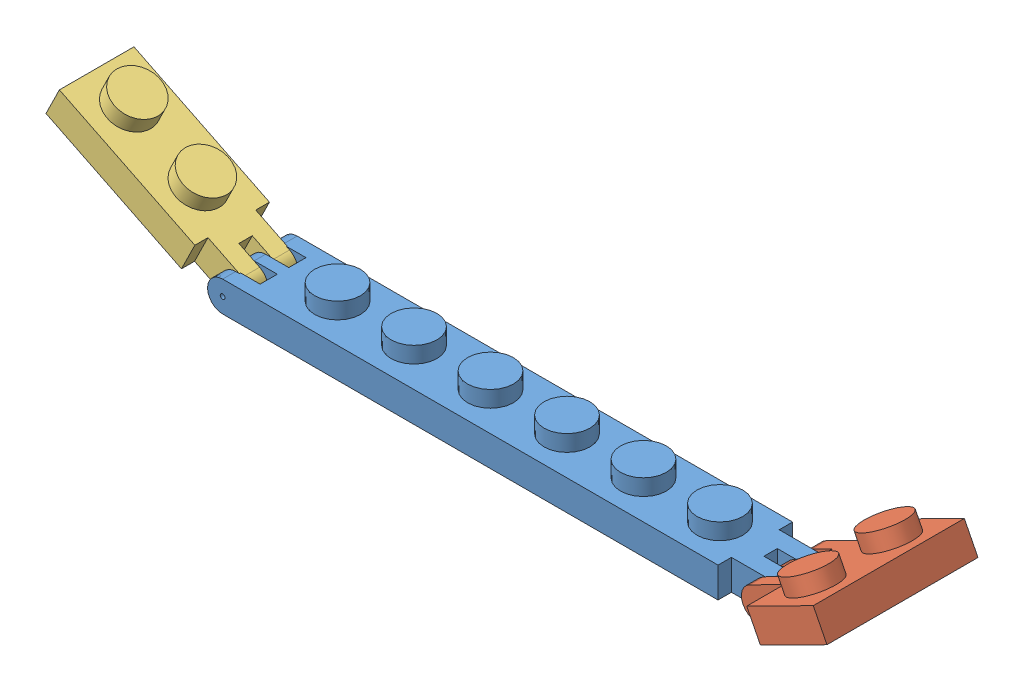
SolidWorks assembly Assem101Rood.SLDASM, configuration Default (file format 4400). Lengths in mm.
Overall size (85.59 13.83 15.8).
3 component instances, 3 part files, 4 mates.
Components (placement in the parent):
- Part0L6BlauwB-1: Part0L6BlauwB.SLDPRT [Default] at origin size (59 4.87 7.8)
- Part0L2Rood scharnier-1: Part0L2Rood scharnier.SLDPRT [Default] at (63.0934 5.5467 -11.9) x (-0.892293 -0.451457 0) z (0 0 -1) size (13.4 4.87 15.8)
- Part0L2RoodB-1: Part0L2RoodB.SLDPRT [Default] at (-8.3243 1.9406 0) x (0 0 -1) z (0.89691 -0.442214 0) size (7.8 4.87 21.4)
Mates (geometry in assembly coordinates):
- Coincident2: coincident aligned: plane of Part0L6BlauwB-1 through (0 3.166 0) normal (0 0 1); plane of Part0L2Rood scharnier-1 through (49.7074 2.3222 0) normal (0 0 1)
- Concentric2: concentric anti-aligned: cylinder of Part0L6BlauwB-1 through (51.82 1.58 -7.8) axis (0 0 1) radius 0.25; cylinder of Part0L2Rood scharnier-1 through (51.82 1.58 3.9) axis (0 0 -1) radius 0.25
- Coincident3: coincident aligned: plane of Part0L6BlauwB-1 through (0 3.166 0) normal (0 0 1); plane of Part0L2RoodB-1 through (-6.9242 4.7802 0) normal (0 0 1)
- Concentric3: concentric anti-aligned: cylinder of Part0L6BlauwB-1 through (-4.02 1.58 0) axis (0 0 -1) radius 0.25; cylinder of Part0L2RoodB-1 through (-4.02 1.58 -7.8) axis (0 0 1) radius 0.25
